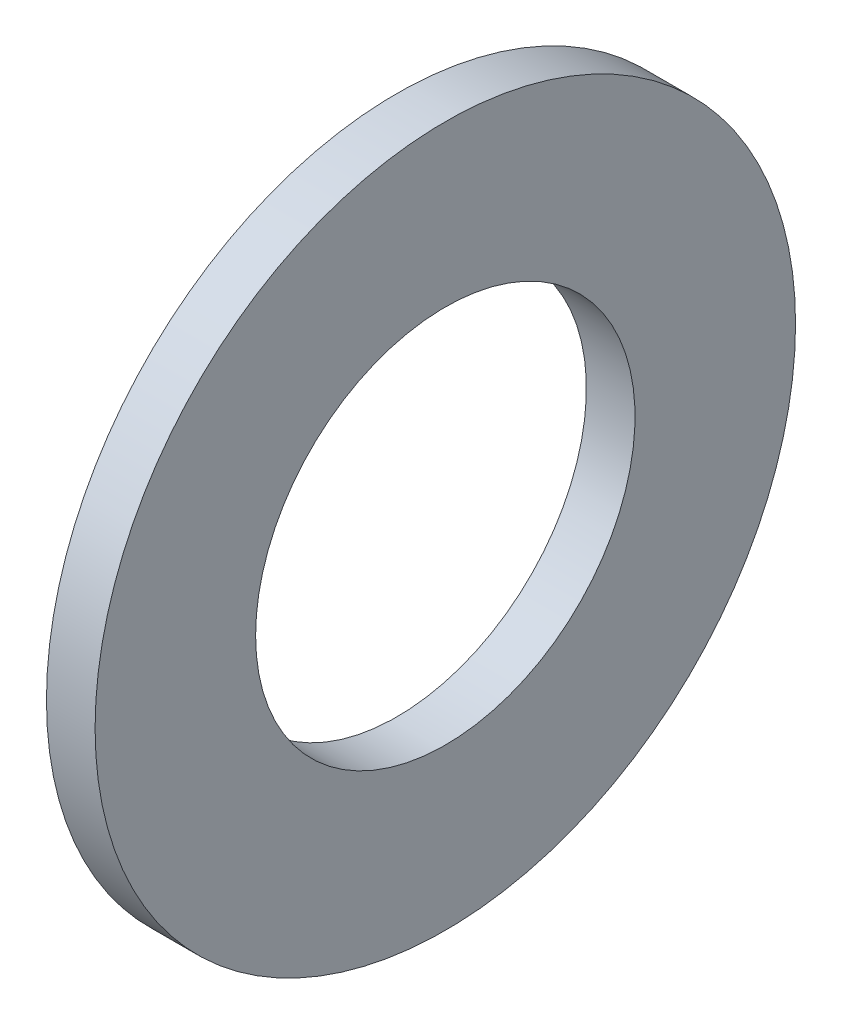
from build123d import *

# Parameters (mm, degrees)
SKETCH1_W = 5
SKETCH1_H = 16.5


with BuildPart() as part:
    # Sketch1 → Base-Revolve (revolve)
    with BuildSketch(Plane.XY, mode=Mode.PRIVATE) as base_revolve_sk:
        with Locations((-2.5, 27.75)):
            Rectangle(SKETCH1_W, SKETCH1_H)
    revolve(base_revolve_sk.sketch.rotate(Axis((-34.925, 0, 0), (1, 0, 0)), 90), axis=Axis((-34.925, 0, 0), (1, 0, 0)))


solid = part.part
